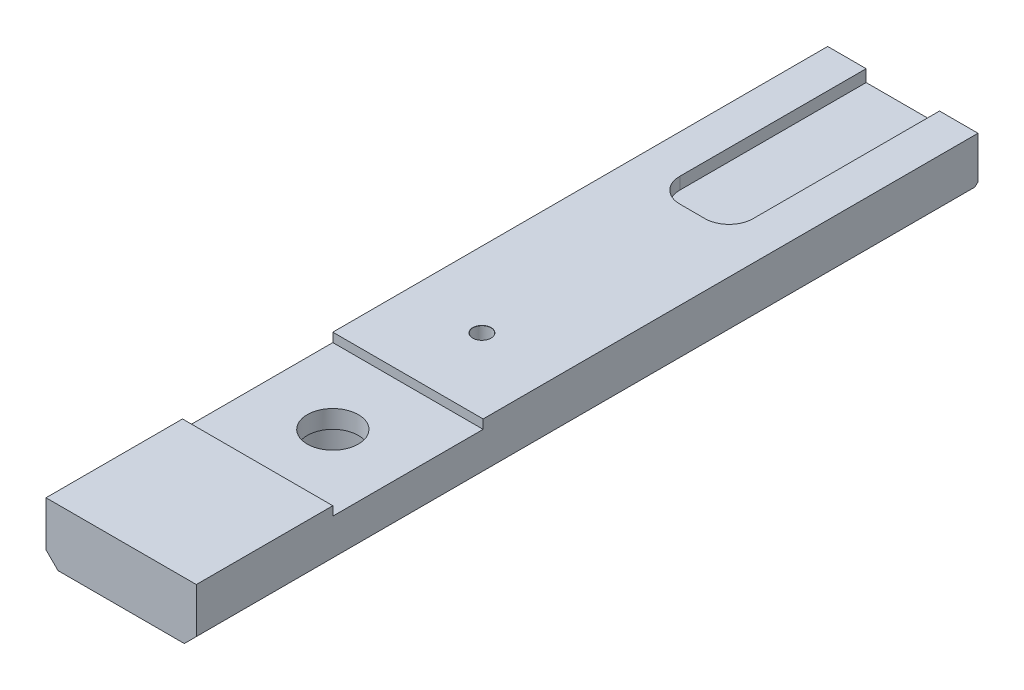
from build123d import *

# Parameters (mm, degrees)
BASE_EXTRUSION_DEPTH                    = 130
CHANFREIN1_SIZE                         = 0.5
ESQUISSE2_W                             = 25
ESQUISSE2_H                             = 1.5
ENL_V_MAT_EXTRU_1_DEPTH                 = 133.880585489
ESQUISSE5_R                             = 4.25
ENL_V_MAT_EXTRU_2_DEPTH                 = 131.981868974
ENL_V_MAT_EXTRU_3_DEPTH                 = 140
ENL_V_MAT_EXTRU_3_DEPTH_BACK            = 5.5
ESQUISSE6_R                             = 7
CHANFREIN2_SIZE                         = 4
DIAM_TRE_DU_PER_AGE_3_0_3_1_D           = 3
DIAM_TRE_DU_PER_AGE_3_0_3_1_CSINK_D     = 3.05
DIAM_TRE_DU_PER_AGE_3_0_3_1_CSINK_ANGLE = 90
ESQUISSE9_W                             = 12.2
ESQUISSE9_H                             = 2
ENL_V_MAT_EXTRU_4_DEPTH                 = 35
CONG_1_R                                = 4
CHANFREIN3_SIZE                         = 0.8


with BuildPart() as part:
    # Esquisse1 → Base-Extrusion (new body)
    with BuildSketch(Plane.XY):
        Polygon((-12.5, 0), (-6.1, 0), (-6.1, 1.5), (6.1, 1.5), (6.1, 0), (12.5, 0), (12.5, 11.5), (-12.5, 11.5), align=None)
    extrude(amount=BASE_EXTRUSION_DEPTH)

    # Chanfrein1
    chanfrein1_edges = [part.edges().sort_by_distance(p)[0] for p in [
        (6.1, 0, 65),
        (-6.1, 0, 65),
    ]]
    chamfer(chanfrein1_edges, length=CHANFREIN1_SIZE)

    # Esquisse2 → Enl_v. mat.-Extru.1 (cut, through all)
    with BuildSketch(Plane(origin=(12.5, 0, 0), x_dir=(0, 0, -1), z_dir=(1, 0, 0))):
        Polygon((-130, 2), (-128, 0), (-130, 0), align=None)
        Polygon((0, 4.5), (-4.5, 0), (0, 0), align=None)
        with Locations((-94.8, 10.75)):
            Rectangle(ESQUISSE2_W, ESQUISSE2_H)
    extrude(amount=-ENL_V_MAT_EXTRU_1_DEPTH, mode=Mode.SUBTRACT)

    # Esquisse5 → Enl_v. mat.-Extru.2 (cut, through all)
    with BuildSketch(Plane(origin=(0, 10, 0), x_dir=(-1, 0, 0), z_dir=(0, 1, 0))):
        with Locations(Location((0, 94.8, 0), (0, 0, 90))):
            Circle(ESQUISSE5_R)
    extrude(amount=-ENL_V_MAT_EXTRU_2_DEPTH, mode=Mode.SUBTRACT)

    # Esquisse6 → Enl_v. mat.-Extru.3 (cut, two sides: drawn at the far end of the back side and taken through both)
    with BuildSketch(Plane.XZ.offset(-1.5).offset(-ENL_V_MAT_EXTRU_3_DEPTH_BACK)):
        with Locations(Location((0, 94.8, 0), (0, 0, 270))):
            Circle(ESQUISSE6_R)
    extrude(amount=ENL_V_MAT_EXTRU_3_DEPTH + ENL_V_MAT_EXTRU_3_DEPTH_BACK, mode=Mode.SUBTRACT)

    # Chanfrein2
    chanfrein2_edges = [part.edges().sort_by_distance(p)[0] for p in [
        (12.5, 0, 66.25),
        (-12.5, 0, 66.25),
    ]]
    chamfer(chanfrein2_edges, length=CHANFREIN2_SIZE)

    # Diam_tre du per_age _3.0 _3_1 (through all)
    with Locations(Plane(origin=(0, 11.5, 0), x_dir=(1, 0, 0), z_dir=(0, 1, 0))):
        with Locations((0, -70)):
            CounterSinkHole(DIAM_TRE_DU_PER_AGE_3_0_3_1_D / 2, DIAM_TRE_DU_PER_AGE_3_0_3_1_CSINK_D / 2, counter_sink_angle=DIAM_TRE_DU_PER_AGE_3_0_3_1_CSINK_ANGLE)

    # Esquisse9 → Enl_v. mat.-Extru.4 (cut)
    with BuildSketch(Plane(origin=(0, 0, 0), x_dir=(-1, 0, 0), z_dir=(0, 0, -1))):
        with Locations((0, 10.5)):
            Rectangle(ESQUISSE9_W, ESQUISSE9_H)
    extrude(amount=-ENL_V_MAT_EXTRU_4_DEPTH, mode=Mode.SUBTRACT)

    # Cong_1
    cong_1_edges = [part.edges().sort_by_distance(p)[0] for p in [
        (6.1, 10.5, 35),
        (-6.1, 10.5, 35),
    ]]
    fillet(cong_1_edges, radius=CONG_1_R)

    # Chanfrein3
    chanfrein3_edges = [part.edges().sort_by_distance(p)[0] for p in [
        (1.5, 1.5, 70),
    ]]
    chamfer(chanfrein3_edges, length=CHANFREIN3_SIZE)


solid = part.part
